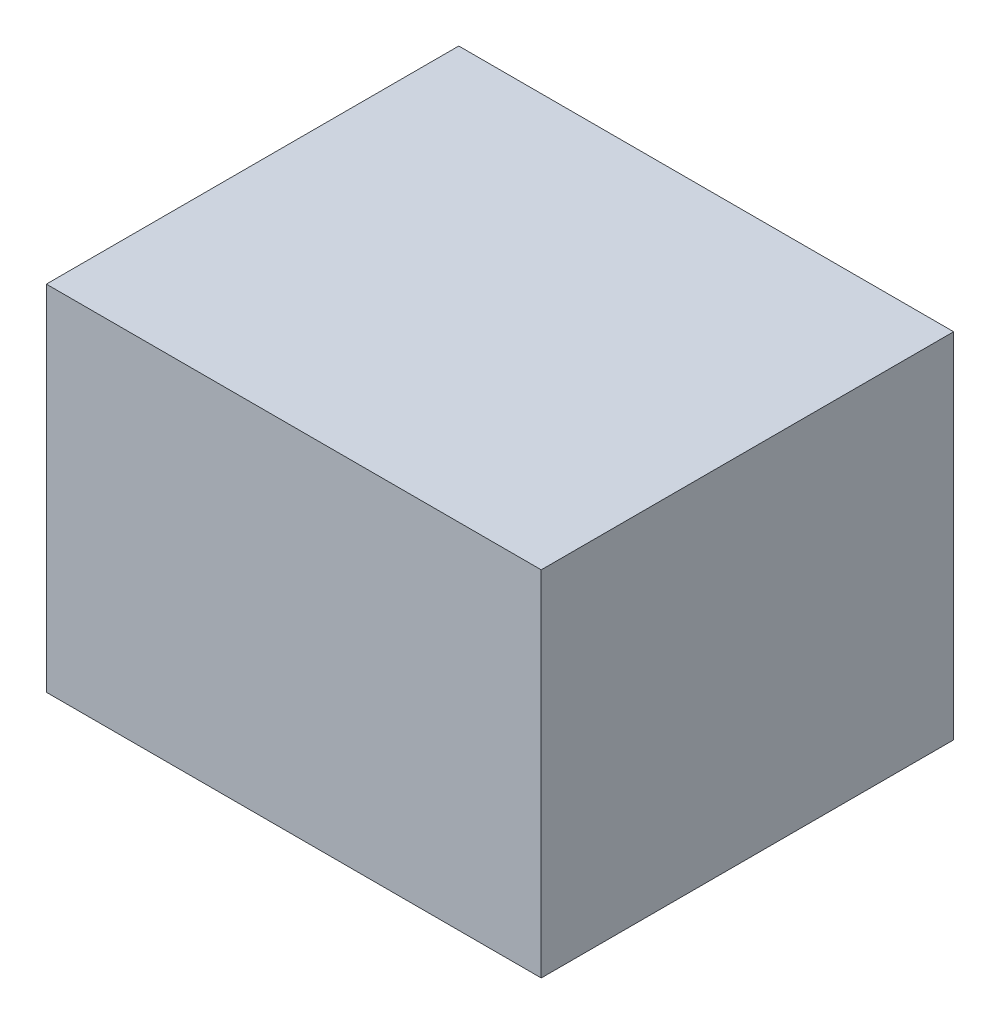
from build123d import *

# Parameters (mm, degrees)
CROQUIS3_W              = 420
CROQUIS3_H              = 300
SALIENTE_EXTRUIR1_DEPTH = 350


with BuildPart() as part:
    # Croquis3 → Saliente-Extruir1 (new body)
    with BuildSketch(Plane.XY):
        Rectangle(CROQUIS3_W, CROQUIS3_H)
    extrude(amount=SALIENTE_EXTRUIR1_DEPTH)


solid = part.part
